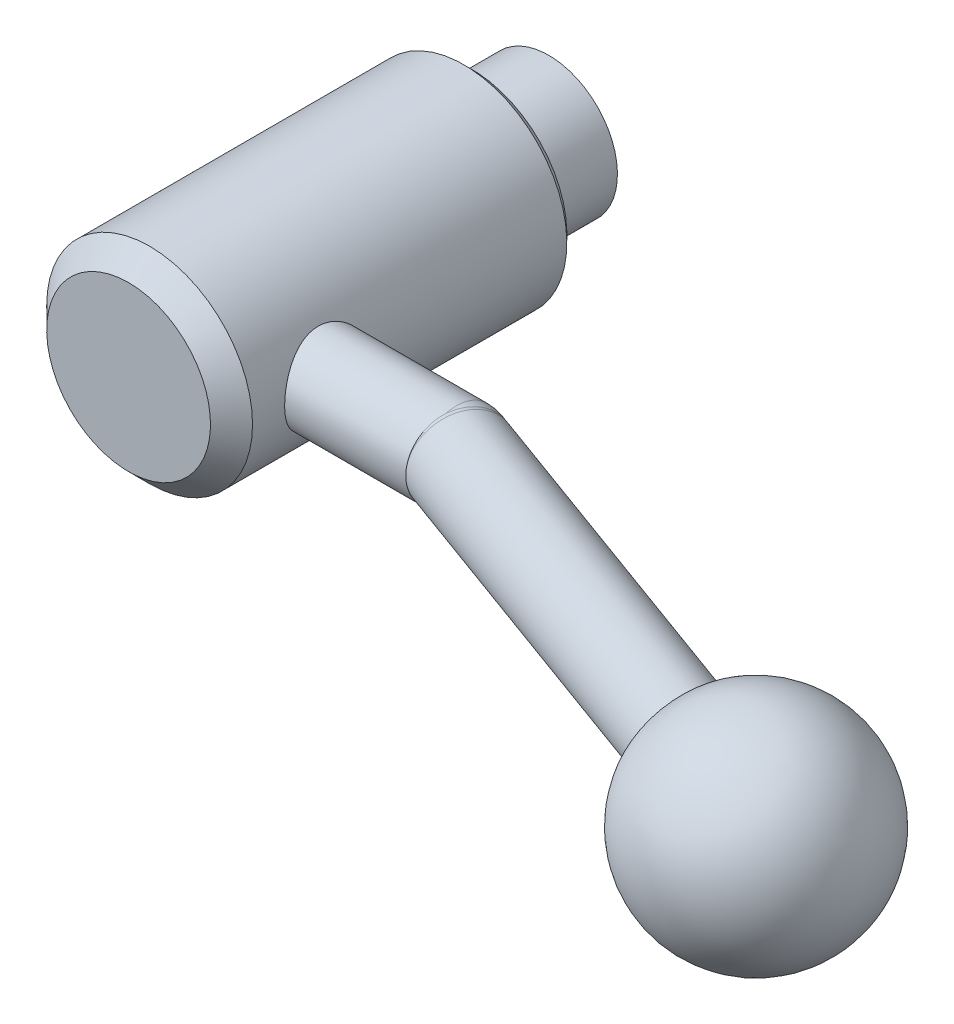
ISO-10303-21;
HEADER;
FILE_DESCRIPTION(('STEP AP214'),'2;1');
FILE_NAME('part.step','',(''),(''),'','','');
FILE_SCHEMA(('AUTOMOTIVE_DESIGN { 1 0 10303 214 1 1 1 1 }'));
ENDSEC;
DATA;
#1=APPLICATION_CONTEXT('core data for automotive mechanical design processes');
#2=APPLICATION_PROTOCOL_DEFINITION('international standard','automotive_design',2000,#1);
#3=PRODUCT_CONTEXT('',#1,'mechanical');
#4=PRODUCT('Part','Part','',(#3));
#5=PRODUCT_RELATED_PRODUCT_CATEGORY('part','',(#4));
#6=PRODUCT_DEFINITION_FORMATION('','',#4);
#7=PRODUCT_DEFINITION_CONTEXT('part definition',#1,'design');
#8=PRODUCT_DEFINITION('design','',#6,#7);
#9=PRODUCT_DEFINITION_SHAPE('','',#8);
#10=(LENGTH_UNIT() NAMED_UNIT(*) SI_UNIT(.MILLI.,.METRE.));
#11=(NAMED_UNIT(*) PLANE_ANGLE_UNIT() SI_UNIT($,.RADIAN.));
#12=(NAMED_UNIT(*) SI_UNIT($,.STERADIAN.) SOLID_ANGLE_UNIT());
#13=UNCERTAINTY_MEASURE_WITH_UNIT(LENGTH_MEASURE(1.E-05),#10,'distance_accuracy_value','');
#14=(GEOMETRIC_REPRESENTATION_CONTEXT(3) GLOBAL_UNCERTAINTY_ASSIGNED_CONTEXT((#13)) GLOBAL_UNIT_ASSIGNED_CONTEXT((#10,
#11,#12)) REPRESENTATION_CONTEXT('',''));
#15=CARTESIAN_POINT('',(0.,0.,0.));
#16=DIRECTION('',(0.,0.,1.));
#17=DIRECTION('',(1.,0.,0.));
#18=AXIS2_PLACEMENT_3D('',#15,#16,#17);
#19=CARTESIAN_POINT('',(4.,0.,0.));
#20=DIRECTION('',(0.,0.,-1.));
#21=DIRECTION('',(0.,1.,0.));
#22=AXIS2_PLACEMENT_3D('',#19,#20,#21);
#23=PLANE('',#22);
#24=CARTESIAN_POINT('',(0.,0.,0.));
#25=DIRECTION('',(0.,0.,-1.));
#26=DIRECTION('',(-1.,0.,0.));
#27=AXIS2_PLACEMENT_3D('',#24,#25,#26);
#28=CIRCLE('',#27,5.65);
#29=CARTESIAN_POINT('',(-5.65,0.,0.));
#30=VERTEX_POINT('',#29);
#31=EDGE_CURVE('E9',#30,#30,#28,.F.);
#32=ORIENTED_EDGE('',*,*,#31,.T.);
#33=EDGE_LOOP('',(#32));
#34=FACE_BOUND('',#33,.T.);
#35=CARTESIAN_POINT('',(0.,0.,0.));
#36=DIRECTION('',(0.,0.,1.));
#37=DIRECTION('',(0.,-1.,0.));
#38=AXIS2_PLACEMENT_3D('',#35,#36,#37);
#39=CIRCLE('',#38,8.);
#40=CARTESIAN_POINT('',(0.,-8.,0.));
#41=VERTEX_POINT('',#40);
#42=EDGE_CURVE('E286',#41,#41,#39,.T.);
#43=ORIENTED_EDGE('',*,*,#42,.F.);
#44=EDGE_LOOP('',(#43));
#45=FACE_BOUND('',#44,.T.);
#46=ADVANCED_FACE('F14',(#34,#45),#23,.T.);
#47=CARTESIAN_POINT('',(0.,0.,4.5));
#48=DIRECTION('',(0.,0.,1.));
#49=DIRECTION('',(0.,-1.,0.));
#50=AXIS2_PLACEMENT_3D('',#47,#48,#49);
#51=CYLINDRICAL_SURFACE('',#50,8.);
#52=CARTESIAN_POINT('',(0.,0.,9.));
#53=DIRECTION('',(0.,0.,1.));
#54=DIRECTION('',(0.,-1.,0.));
#55=AXIS2_PLACEMENT_3D('',#52,#53,#54);
#56=CIRCLE('',#55,8.);
#57=CARTESIAN_POINT('',(0.,-8.,9.));
#58=VERTEX_POINT('',#57);
#59=EDGE_CURVE('E281',#58,#58,#56,.T.);
#60=ORIENTED_EDGE('',*,*,#59,.F.);
#61=EDGE_LOOP('',(#60));
#62=FACE_BOUND('',#61,.T.);
#63=ORIENTED_EDGE('',*,*,#42,.T.);
#64=EDGE_LOOP('',(#63));
#65=FACE_BOUND('',#64,.T.);
#66=ADVANCED_FACE('F175',(#62,#65),#51,.T.);
#67=CARTESIAN_POINT('',(9.55,0.,9.));
#68=DIRECTION('',(0.,0.,-1.));
#69=DIRECTION('',(0.,1.,0.));
#70=AXIS2_PLACEMENT_3D('',#67,#68,#69);
#71=PLANE('',#70);
#72=ORIENTED_EDGE('',*,*,#59,.T.);
#73=EDGE_LOOP('',(#72));
#74=FACE_BOUND('',#73,.T.);
#75=CARTESIAN_POINT('',(0.,0.,9.));
#76=DIRECTION('',(0.,0.,1.));
#77=DIRECTION('',(0.,-1.,0.));
#78=AXIS2_PLACEMENT_3D('',#75,#76,#77);
#79=CIRCLE('',#78,11.1);
#80=CARTESIAN_POINT('',(0.,-11.1,9.));
#81=VERTEX_POINT('',#80);
#82=EDGE_CURVE('E277',#81,#81,#79,.T.);
#83=ORIENTED_EDGE('',*,*,#82,.F.);
#84=EDGE_LOOP('',(#83));
#85=FACE_BOUND('',#84,.T.);
#86=ADVANCED_FACE('F185',(#74,#85),#71,.T.);
#87=CARTESIAN_POINT('',(4.775,0.,49.));
#88=DIRECTION('',(0.,0.,1.));
#89=DIRECTION('',(0.,-1.,0.));
#90=AXIS2_PLACEMENT_3D('',#87,#88,#89);
#91=PLANE('',#90);
#92=CARTESIAN_POINT('',(0.,0.,49.));
#93=DIRECTION('',(0.,0.,-1.));
#94=DIRECTION('',(0.,1.,0.));
#95=AXIS2_PLACEMENT_3D('',#92,#93,#94);
#96=CIRCLE('',#95,9.55);
#97=CARTESIAN_POINT('',(0.,9.55,49.));
#98=VERTEX_POINT('',#97);
#99=EDGE_CURVE('E274',#98,#98,#96,.T.);
#100=ORIENTED_EDGE('',*,*,#99,.F.);
#101=EDGE_LOOP('',(#100));
#102=FACE_BOUND('',#101,.T.);
#103=ADVANCED_FACE('F195',(#102),#91,.T.);
#104=CARTESIAN_POINT('',(0.,0.,9.9));
#105=DIRECTION('',(0.,0.,1.));
#106=DIRECTION('',(0.,-1.,0.));
#107=AXIS2_PLACEMENT_3D('',#104,#105,#106);
#108=CONICAL_SURFACE('',#107,12.,0.785398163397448);
#109=ORIENTED_EDGE('',*,*,#82,.T.);
#110=EDGE_LOOP('',(#109));
#111=FACE_BOUND('',#110,.T.);
#112=CARTESIAN_POINT('',(0.,0.,9.9));
#113=DIRECTION('',(0.,0.,1.));
#114=DIRECTION('',(0.,-1.,0.));
#115=AXIS2_PLACEMENT_3D('',#112,#113,#114);
#116=CIRCLE('',#115,12.);
#117=CARTESIAN_POINT('',(0.,-12.,9.9));
#118=VERTEX_POINT('',#117);
#119=EDGE_CURVE('E107',#118,#118,#116,.T.);
#120=ORIENTED_EDGE('',*,*,#119,.F.);
#121=EDGE_LOOP('',(#120));
#122=FACE_BOUND('',#121,.T.);
#123=ADVANCED_FACE('F205',(#111,#122),#108,.T.);
#124=CARTESIAN_POINT('',(0.,0.,46.55));
#125=DIRECTION('',(0.,0.,-1.));
#126=DIRECTION('',(0.,1.,0.));
#127=AXIS2_PLACEMENT_3D('',#124,#125,#126);
#128=CONICAL_SURFACE('',#127,12.,0.785398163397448);
#129=CARTESIAN_POINT('',(0.,0.,46.55));
#130=DIRECTION('',(0.,0.,1.));
#131=DIRECTION('',(0.,-1.,0.));
#132=AXIS2_PLACEMENT_3D('',#129,#130,#131);
#133=CIRCLE('',#132,12.);
#134=CARTESIAN_POINT('',(0.,-12.,46.55));
#135=VERTEX_POINT('',#134);
#136=EDGE_CURVE('E47',#135,#135,#133,.F.);
#137=ORIENTED_EDGE('',*,*,#136,.F.);
#138=EDGE_LOOP('',(#137));
#139=FACE_BOUND('',#138,.T.);
#140=ORIENTED_EDGE('',*,*,#99,.T.);
#141=EDGE_LOOP('',(#140));
#142=FACE_BOUND('',#141,.T.);
#143=ADVANCED_FACE('F215',(#139,#142),#128,.T.);
#144=CARTESIAN_POINT('',(0.,0.,28.225));
#145=DIRECTION('',(0.,0.,1.));
#146=DIRECTION('',(0.,-1.,0.));
#147=AXIS2_PLACEMENT_3D('',#144,#145,#146);
#148=CYLINDRICAL_SURFACE('',#147,12.);
#149=ORIENTED_EDGE('',*,*,#119,.T.);
#150=EDGE_LOOP('',(#149));
#151=FACE_BOUND('',#150,.T.);
#152=ORIENTED_EDGE('',*,*,#136,.T.);
#153=EDGE_LOOP('',(#152));
#154=FACE_BOUND('',#153,.T.);
#155=CARTESIAN_POINT('',(10.9087121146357,-5.,37.8));
#156=CARTESIAN_POINT('',(10.9087074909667,-5.00000435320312,37.6663888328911));
#157=CARTESIAN_POINT('',(10.9111719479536,-4.9946421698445,37.532819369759));
#158=CARTESIAN_POINT('',(10.9209330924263,-4.97326581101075,37.2666742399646));
#159=CARTESIAN_POINT('',(10.9282304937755,-4.95725006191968,37.1340987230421));
#160=CARTESIAN_POINT('',(10.9474176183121,-4.91473148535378,36.8709152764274));
#161=CARTESIAN_POINT('',(10.9593097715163,-4.88822310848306,36.7403084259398));
#162=CARTESIAN_POINT('',(10.9872938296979,-4.82499419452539,36.4820015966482));
#163=CARTESIAN_POINT('',(11.0033874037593,-4.78826959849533,36.3543027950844));
#164=CARTESIAN_POINT('',(11.0391954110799,-4.7051251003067,36.1031731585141));
#165=CARTESIAN_POINT('',(11.0588958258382,-4.65874264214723,35.9797279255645));
#166=CARTESIAN_POINT('',(11.1013704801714,-4.55660310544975,35.7373089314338));
#167=CARTESIAN_POINT('',(11.1241458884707,-4.50084246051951,35.6183368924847));
#168=CARTESIAN_POINT('',(11.1961251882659,-4.32013829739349,35.2691963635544));
#169=CARTESIAN_POINT('',(11.2490137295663,-4.18170265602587,35.0465940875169));
#170=CARTESIAN_POINT('',(11.362232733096,-3.8638933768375,34.6146674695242));
#171=CARTESIAN_POINT('',(11.4228143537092,-3.68265681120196,34.4067915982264));
#172=CARTESIAN_POINT('',(11.5425745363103,-3.28806144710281,34.0231953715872));
#173=CARTESIAN_POINT('',(11.6017524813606,-3.07468881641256,33.8474889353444));
#174=CARTESIAN_POINT('',(11.6861286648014,-2.729351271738,33.6081642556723));
#175=CARTESIAN_POINT('',(11.7140590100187,-2.60716588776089,33.5310867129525));
#176=CARTESIAN_POINT('',(11.7671168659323,-2.35613739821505,33.3875758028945));
#177=CARTESIAN_POINT('',(11.7922454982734,-2.22729698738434,33.3211381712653));
#178=CARTESIAN_POINT('',(11.8389586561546,-1.96390692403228,33.1995551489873));
#179=CARTESIAN_POINT('',(11.8605461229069,-1.82936212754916,33.1444003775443));
#180=CARTESIAN_POINT('',(11.8995627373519,-1.55549044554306,33.0458826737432));
#181=CARTESIAN_POINT('',(11.9169929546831,-1.41616480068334,33.002516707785));
#182=CARTESIAN_POINT('',(11.9541941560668,-1.06793180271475,32.9106955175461));
#183=CARTESIAN_POINT('',(11.971276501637,-0.856830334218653,32.8692715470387));
#184=CARTESIAN_POINT('',(11.9941758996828,-0.430450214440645,32.8139291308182));
#185=CARTESIAN_POINT('',(11.9999946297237,-0.21517219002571,32.8000065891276));
#186=CARTESIAN_POINT('',(12.0000033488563,0.134179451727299,32.799995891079));
#187=CARTESIAN_POINT('',(11.9977460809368,0.268317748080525,32.8054032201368));
#188=CARTESIAN_POINT('',(11.9887853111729,0.535617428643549,32.8269647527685));
#189=CARTESIAN_POINT('',(11.9820811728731,0.668778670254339,32.8431204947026));
#190=CARTESIAN_POINT('',(11.9643973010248,0.933147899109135,32.8860218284));
#191=CARTESIAN_POINT('',(11.953415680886,1.06435499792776,32.9127720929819));
#192=CARTESIAN_POINT('',(11.9274624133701,1.32387896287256,32.9765977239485));
#193=CARTESIAN_POINT('',(11.9124892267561,1.45219469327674,33.0136770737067));
#194=CARTESIAN_POINT('',(11.8789883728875,1.70463818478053,33.0976767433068));
#195=CARTESIAN_POINT('',(11.8604718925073,1.82877771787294,33.1445661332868));
#196=CARTESIAN_POINT('',(11.8203169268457,2.0725349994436,33.2478413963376));
#197=CARTESIAN_POINT('',(11.798677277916,2.1921510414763,33.3042308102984));
#198=CARTESIAN_POINT('',(11.7298504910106,2.54307722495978,33.4869746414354));
#199=CARTESIAN_POINT('',(11.6787242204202,2.76669061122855,33.6269801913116));
#200=CARTESIAN_POINT('',(11.5683077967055,3.19783916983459,33.9465298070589));
#201=CARTESIAN_POINT('',(11.5087513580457,3.40417283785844,34.1275881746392));
#202=CARTESIAN_POINT('',(11.3892960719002,3.78466739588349,34.5211115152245));
#203=CARTESIAN_POINT('',(11.3293970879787,3.95881438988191,34.7335899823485));
#204=CARTESIAN_POINT('',(11.2426695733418,4.19642658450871,35.0777228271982));
#205=CARTESIAN_POINT('',(11.2136418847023,4.27318612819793,35.199855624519));
#206=CARTESIAN_POINT('',(11.1581434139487,4.41607290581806,35.4507224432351));
#207=CARTESIAN_POINT('',(11.1316715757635,4.48220453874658,35.5794537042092));
#208=CARTESIAN_POINT('',(11.0821579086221,4.60326626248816,35.8427214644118));
#209=CARTESIAN_POINT('',(11.0591162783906,4.65819570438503,35.9772582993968));
#210=CARTESIAN_POINT('',(11.017290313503,4.75627570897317,36.2511355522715));
#211=CARTESIAN_POINT('',(10.9985037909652,4.7994323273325,36.3904734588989));
#212=CARTESIAN_POINT('',(10.9666619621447,4.87173601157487,36.6661918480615));
#213=CARTESIAN_POINT('',(10.95337593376,4.9014533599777,36.8023961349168));
#214=CARTESIAN_POINT('',(10.9317788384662,4.94943495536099,37.0771389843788));
#215=CARTESIAN_POINT('',(10.9234654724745,4.96770449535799,37.2156764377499));
#216=CARTESIAN_POINT('',(10.9121183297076,4.99258064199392,37.4939753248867));
#217=CARTESIAN_POINT('',(10.9090831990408,4.9991902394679,37.6337364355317));
#218=CARTESIAN_POINT('',(10.9084052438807,5.00066966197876,37.9133300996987));
#219=CARTESIAN_POINT('',(10.9107621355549,4.99554010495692,38.0531626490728));
#220=CARTESIAN_POINT('',(10.9203897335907,4.97445537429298,38.3209853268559));
#221=CARTESIAN_POINT('',(10.9272683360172,4.95936367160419,38.449058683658));
#222=CARTESIAN_POINT('',(10.9453203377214,4.91939458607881,38.7034023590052));
#223=CARTESIAN_POINT('',(10.956495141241,4.89451400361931,38.8296720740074));
#224=CARTESIAN_POINT('',(10.9827914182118,4.83521904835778,39.079504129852));
#225=CARTESIAN_POINT('',(10.9979119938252,4.80080684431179,39.203067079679));
#226=CARTESIAN_POINT('',(11.0316484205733,4.72276748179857,39.4467742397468));
#227=CARTESIAN_POINT('',(11.0502656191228,4.67913677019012,39.566917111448));
#228=CARTESIAN_POINT('',(11.1114356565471,4.5329201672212,39.9260913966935));
#229=CARTESIAN_POINT('',(11.1587373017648,4.41622884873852,40.1587504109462));
#230=CARTESIAN_POINT('',(11.2607390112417,4.14922979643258,40.6019586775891));
#231=CARTESIAN_POINT('',(11.3154417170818,3.99891004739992,40.8124999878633));
#232=CARTESIAN_POINT('',(11.4317082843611,3.65402282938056,41.2243539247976));
#233=CARTESIAN_POINT('',(11.4934615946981,3.45679190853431,41.423388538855));
#234=CARTESIAN_POINT('',(11.6130178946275,3.03093539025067,41.786433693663));
#235=CARTESIAN_POINT('',(11.6708188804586,2.80229404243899,41.9504265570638));
#236=CARTESIAN_POINT('',(11.7505844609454,2.43719005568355,42.1681695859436));
#237=CARTESIAN_POINT('',(11.7762816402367,2.31013401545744,42.2366869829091));
#238=CARTESIAN_POINT('',(11.8243239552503,2.05007418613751,42.3626787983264));
#239=CARTESIAN_POINT('',(11.8466705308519,1.91707298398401,42.4201579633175));
#240=CARTESIAN_POINT('',(11.8873291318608,1.64624850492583,42.5234355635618));
#241=CARTESIAN_POINT('',(11.9056471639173,1.50843276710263,42.5692514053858));
#242=CARTESIAN_POINT('',(11.9377378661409,1.228899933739,42.6488050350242));
#243=CARTESIAN_POINT('',(11.9515124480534,1.08718450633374,42.6825479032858));
#244=CARTESIAN_POINT('',(11.9750487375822,0.788932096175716,42.7398925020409));
#245=CARTESIAN_POINT('',(11.9843764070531,0.632149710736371,42.7624048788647));
#246=CARTESIAN_POINT('',(11.9968515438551,0.316905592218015,42.7924579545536));
#247=CARTESIAN_POINT('',(11.9999991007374,0.158443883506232,42.7999988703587));
#248=CARTESIAN_POINT('',(12.0000007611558,-0.134110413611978,42.8000009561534));
#249=CARTESIAN_POINT('',(11.9977471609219,-0.268208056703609,42.7946001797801));
#250=CARTESIAN_POINT('',(11.9887940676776,-0.535433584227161,42.7730555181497));
#251=CARTESIAN_POINT('',(11.9820932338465,-0.668561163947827,42.7569083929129));
#252=CARTESIAN_POINT('',(11.9644136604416,-0.932940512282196,42.7140182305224));
#253=CARTESIAN_POINT('',(11.9534307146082,-1.06419030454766,42.6872647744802));
#254=CARTESIAN_POINT('',(11.9274719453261,-1.32379800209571,42.6234258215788));
#255=CARTESIAN_POINT('',(11.9124945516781,-1.45215474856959,42.5863362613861));
#256=CARTESIAN_POINT('',(11.8789871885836,-1.70464692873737,42.5023203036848));
#257=CARTESIAN_POINT('',(11.8604692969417,-1.82879507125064,42.4554272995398));
#258=CARTESIAN_POINT('',(11.8203109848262,-2.07256946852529,42.3521432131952));
#259=CARTESIAN_POINT('',(11.798669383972,-2.19219399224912,42.2957485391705));
#260=CARTESIAN_POINT('',(11.7298430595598,-2.5431097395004,42.1130050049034));
#261=CARTESIAN_POINT('',(11.678720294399,-2.76670593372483,41.9730084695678));
#262=CARTESIAN_POINT('',(11.5683124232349,-3.19782111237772,41.6534835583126));
#263=CARTESIAN_POINT('',(11.5087611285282,-3.40413902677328,41.4724414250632));
#264=CARTESIAN_POINT('',(11.3893058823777,-3.78463884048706,41.0789233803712));
#265=CARTESIAN_POINT('',(11.3294017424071,-3.95880157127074,40.8664288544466));
#266=CARTESIAN_POINT('',(11.2426570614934,-4.19646089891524,40.5222273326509));
#267=CARTESIAN_POINT('',(11.2136175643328,-4.27325053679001,40.4000414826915));
#268=CARTESIAN_POINT('',(11.1580975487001,-4.41618919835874,40.1490631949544));
#269=CARTESIAN_POINT('',(11.1316160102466,-4.48234247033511,40.0202734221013));
#270=CARTESIAN_POINT('',(11.0821110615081,-4.60337872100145,39.757006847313));
#271=CARTESIAN_POINT('',(11.059084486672,-4.65827203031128,39.6225353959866));
#272=CARTESIAN_POINT('',(11.0172786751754,-4.75630122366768,39.3487863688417));
#273=CARTESIAN_POINT('',(10.9984982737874,-4.79944033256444,39.2095101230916));
#274=CARTESIAN_POINT('',(10.9584249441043,-4.89044651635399,38.8624381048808));
#275=CARTESIAN_POINT('',(10.9399177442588,-4.93143703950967,38.6524635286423));
#276=CARTESIAN_POINT('',(10.9150663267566,-4.98620740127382,38.228289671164));
#277=CARTESIAN_POINT('',(10.9087195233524,-4.9999930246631,38.0140912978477));
#278=CARTESIAN_POINT('',(10.9087121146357,-5.,37.8));
#279=B_SPLINE_CURVE_WITH_KNOTS('',3,(#155,#156,#157,#158,#159,#160,#161,#162,#163,#164,#165,
#166,#167,#168,#169,#170,#171,#172,#173,#174,#175,#176,#177,#178,#179,#180,#181,#182,#183,#184,
#185,#186,#187,#188,#189,#190,#191,#192,#193,#194,#195,#196,#197,#198,#199,#200,#201,#202,#203,
#204,#205,#206,#207,#208,#209,#210,#211,#212,#213,#214,#215,#216,#217,#218,#219,#220,#221,#222,
#223,#224,#225,#226,#227,#228,#229,#230,#231,#232,#233,#234,#235,#236,#237,#238,#239,#240,#241,
#242,#243,#244,#245,#246,#247,#248,#249,#250,#251,#252,#253,#254,#255,#256,#257,#258,#259,#260,
#261,#262,#263,#264,#265,#266,#267,#268,#269,#270,#271,#272,#273,#274,#275,#276,#277,#278),
.UNSPECIFIED.,.T.,.F.,(4,2,2,2,2,2,2,2,2,2,2,2,2,2,2,2,2,2,2,2,2,2,2,2,2,2,2,2,2,2,2,2,2,2,2,2,
2,2,2,2,2,2,2,2,2,2,2,2,2,2,2,2,2,2,2,2,2,2,2,2,2,4),(0.,0.400632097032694,0.801323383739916,
1.20222687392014,1.60328987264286,2.00282595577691,2.4025143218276,3.20122978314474,
4.04481584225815,4.88876604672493,5.32972022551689,5.77049723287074,6.21090626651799,
6.65120186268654,7.29649650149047,7.94169502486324,8.34403504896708,8.74643267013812,
9.14900797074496,9.55173873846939,9.95321838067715,10.3548479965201,11.1573969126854,
11.9966160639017,12.8361966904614,13.2771668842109,13.7179540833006,14.1587668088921,
14.5993523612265,15.0189121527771,15.4382778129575,15.8575358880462,16.2767718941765,
16.6637453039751,17.0508453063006,17.4378573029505,17.8250187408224,18.6150346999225,
19.405333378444,20.2623217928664,21.1197415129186,21.5591319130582,21.9983329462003,
22.4368746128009,22.875231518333,23.3503940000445,23.8255495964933,24.2277318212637,
24.6300353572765,25.0327350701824,25.4355933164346,25.8371010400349,26.2387608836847,
27.041251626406,27.880402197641,28.7200514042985,29.161206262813,29.6021844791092,
30.042756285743,30.4832070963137,31.1252948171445,31.767245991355),.UNSPECIFIED.);
#280=CARTESIAN_POINT('',(10.9087121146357,-5.,37.8));
#281=VERTEX_POINT('',#280);
#282=EDGE_CURVE('E46',#281,#281,#279,.T.);
#283=ORIENTED_EDGE('',*,*,#282,.F.);
#284=EDGE_LOOP('',(#283));
#285=FACE_BOUND('',#284,.T.);
#286=ADVANCED_FACE('F225',(#151,#154,#285),#148,.T.);
#287=CARTESIAN_POINT('',(27.,0.,37.8));
#288=DIRECTION('',(1.,0.,0.));
#289=DIRECTION('',(0.,0.,1.));
#290=AXIS2_PLACEMENT_3D('',#287,#288,#289);
#291=SPHERICAL_SURFACE('',#290,5.);
#292=CARTESIAN_POINT('',(27.,0.,37.8));
#293=DIRECTION('',(-1.,0.,0.));
#294=DIRECTION('',(0.,-1.,0.));
#295=AXIS2_PLACEMENT_3D('',#292,#293,#294);
#296=CIRCLE('',#295,5.);
#297=CARTESIAN_POINT('',(27.,4.83102779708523,39.0888640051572));
#298=VERTEX_POINT('',#297);
#299=CARTESIAN_POINT('',(27.,-4.83102779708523,39.0888640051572));
#300=VERTEX_POINT('',#299);
#301=EDGE_CURVE('E35',#298,#300,#296,.T.);
#302=ORIENTED_EDGE('',*,*,#301,.F.);
#303=CARTESIAN_POINT('',(27.,-4.83102779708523,39.0888640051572));
#304=CARTESIAN_POINT('',(27.046470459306,-4.86510599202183,38.9611874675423));
#305=CARTESIAN_POINT('',(27.0934341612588,-4.89342279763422,38.832155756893));
#306=CARTESIAN_POINT('',(27.1880079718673,-4.93839650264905,38.5723163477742));
#307=CARTESIAN_POINT('',(27.2356180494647,-4.95505396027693,38.441508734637));
#308=CARTESIAN_POINT('',(27.331115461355,-4.97656756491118,38.179131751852));
#309=CARTESIAN_POINT('',(27.379002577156,-4.9814320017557,38.0475629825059));
#310=CARTESIAN_POINT('',(27.4747462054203,-4.9793538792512,37.7845095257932));
#311=CARTESIAN_POINT('',(27.5226027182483,-4.97241146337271,37.6530248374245));
#312=CARTESIAN_POINT('',(27.6179594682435,-4.94676429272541,37.39103432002));
#313=CARTESIAN_POINT('',(27.665459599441,-4.92805616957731,37.2605287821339));
#314=CARTESIAN_POINT('',(27.7597694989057,-4.87899874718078,37.0014144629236));
#315=CARTESIAN_POINT('',(27.8065790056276,-4.8486451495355,36.8728064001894));
#316=CARTESIAN_POINT('',(27.8991305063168,-4.77653351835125,36.6185232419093));
#317=CARTESIAN_POINT('',(27.9448730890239,-4.73478194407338,36.4928465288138));
#318=CARTESIAN_POINT('',(28.0350097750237,-4.6401460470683,36.2451980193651));
#319=CARTESIAN_POINT('',(28.0794033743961,-4.58725762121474,36.1232276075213));
#320=CARTESIAN_POINT('',(28.1664936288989,-4.47075360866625,35.8839490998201));
#321=CARTESIAN_POINT('',(28.2091908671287,-4.40714174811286,35.7666394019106));
#322=CARTESIAN_POINT('',(28.2926167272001,-4.2696046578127,35.5374287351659));
#323=CARTESIAN_POINT('',(28.3333446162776,-4.19567562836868,35.4255297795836));
#324=CARTESIAN_POINT('',(28.4125166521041,-4.03806489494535,35.2080063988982));
#325=CARTESIAN_POINT('',(28.4509612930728,-3.95438531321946,35.1023806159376));
#326=CARTESIAN_POINT('',(28.5253169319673,-3.77782268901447,34.8980901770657));
#327=CARTESIAN_POINT('',(28.5612269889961,-3.68493625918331,34.7994281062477));
#328=CARTESIAN_POINT('',(28.6302280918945,-3.49068679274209,34.6098491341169));
#329=CARTESIAN_POINT('',(28.6633202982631,-3.38932728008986,34.5189290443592));
#330=CARTESIAN_POINT('',(28.7264788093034,-3.17877990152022,34.3454024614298));
#331=CARTESIAN_POINT('',(28.7565439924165,-3.06958915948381,34.2627990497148));
#332=CARTESIAN_POINT('',(28.8134084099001,-2.84423774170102,34.1065653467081));
#333=CARTESIAN_POINT('',(28.8402090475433,-2.72808009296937,34.0329311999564));
#334=CARTESIAN_POINT('',(28.8903782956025,-2.4895338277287,33.8950923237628));
#335=CARTESIAN_POINT('',(28.9137456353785,-2.36714292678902,33.8308910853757));
#336=CARTESIAN_POINT('',(28.9568627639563,-2.11708267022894,33.7124277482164));
#337=CARTESIAN_POINT('',(28.9766138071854,-1.98941516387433,33.6581622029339));
#338=CARTESIAN_POINT('',(29.0123746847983,-1.72962465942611,33.5599099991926));
#339=CARTESIAN_POINT('',(29.0283831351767,-1.5975000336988,33.5159271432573));
#340=CARTESIAN_POINT('',(29.0565303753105,-1.32981336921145,33.4385932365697));
#341=CARTESIAN_POINT('',(29.0686705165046,-1.19425254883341,33.40523847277));
#342=CARTESIAN_POINT('',(29.0890073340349,-0.920611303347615,33.3493635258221));
#343=CARTESIAN_POINT('',(29.0972025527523,-0.782529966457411,33.3268473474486));
#344=CARTESIAN_POINT('',(29.1157561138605,-0.366076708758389,33.275871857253));
#345=CARTESIAN_POINT('',(29.1201131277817,-0.0852019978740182,33.2639010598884));
#346=CARTESIAN_POINT('',(29.1126324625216,0.474546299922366,33.2844540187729));
#347=CARTESIAN_POINT('',(29.1007947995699,0.753419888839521,33.3169777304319));
#348=CARTESIAN_POINT('',(29.0612756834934,1.30144109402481,33.4255556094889));
#349=CARTESIAN_POINT('',(29.0335941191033,1.5705886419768,33.5016100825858));
#350=CARTESIAN_POINT('',(28.9631693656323,2.09146114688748,33.695100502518));
#351=CARTESIAN_POINT('',(28.9204263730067,2.34318633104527,33.8125359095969));
#352=CARTESIAN_POINT('',(28.8210936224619,2.82208357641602,34.085450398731));
#353=CARTESIAN_POINT('',(28.764504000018,3.04925587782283,34.2409291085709));
#354=CARTESIAN_POINT('',(28.6390816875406,3.47260490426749,34.5855240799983));
#355=CARTESIAN_POINT('',(28.570248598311,3.66878061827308,34.7746414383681));
#356=CARTESIAN_POINT('',(28.4222952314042,4.02455922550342,35.1811399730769));
#357=CARTESIAN_POINT('',(28.3431749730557,4.18416218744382,35.3985210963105));
#358=CARTESIAN_POINT('',(28.1768942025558,4.46226027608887,35.8553737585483));
#359=CARTESIAN_POINT('',(28.0897339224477,4.58075658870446,36.0948446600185));
#360=CARTESIAN_POINT('',(27.9098378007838,4.77329945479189,36.5891051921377));
#361=CARTESIAN_POINT('',(27.8171011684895,4.84733968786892,36.8438969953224));
#362=CARTESIAN_POINT('',(27.6287009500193,4.94882287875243,37.3615223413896));
#363=CARTESIAN_POINT('',(27.5330381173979,4.97627773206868,37.6243538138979));
#364=CARTESIAN_POINT('',(27.3636614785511,4.98299294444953,38.0897123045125));
#365=CARTESIAN_POINT('',(27.2899803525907,4.97191840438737,38.2921495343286));
#366=CARTESIAN_POINT('',(27.1803577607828,4.93453780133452,38.593335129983));
#367=CARTESIAN_POINT('',(27.1439766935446,4.91862341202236,38.6932912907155));
#368=CARTESIAN_POINT('',(27.0716363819,4.87994547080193,38.8920446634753));
#369=CARTESIAN_POINT('',(27.035677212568,4.8571807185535,38.9908416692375));
#370=CARTESIAN_POINT('',(27.,4.83102779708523,39.0888640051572));
#371=B_SPLINE_CURVE_WITH_KNOTS('',3,(#303,#304,#305,#306,#307,#308,#309,#310,#311,#312,#313,
#314,#315,#316,#317,#318,#319,#320,#321,#322,#323,#324,#325,#326,#327,#328,#329,#330,#331,#332,
#333,#334,#335,#336,#337,#338,#339,#340,#341,#342,#343,#344,#345,#346,#347,#348,#349,#350,#351,
#352,#353,#354,#355,#356,#357,#358,#359,#360,#361,#362,#363,#364,#365,#366,#367,#368,#369,#370),
.UNSPECIFIED.,.F.,.F.,(4,2,2,2,2,2,2,2,2,2,2,2,2,2,2,2,2,2,2,2,2,2,2,2,2,2,2,2,2,2,2,2,2,4),(0.,
0.420108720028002,0.840197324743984,1.25999054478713,1.67977866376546,2.09968701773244,
2.51975051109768,2.93957644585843,3.35955732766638,3.77939257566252,4.19938285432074,
4.61928189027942,5.0393359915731,5.45921625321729,5.87925151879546,6.2991055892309,
6.71911465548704,7.13897775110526,7.55899586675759,7.97886708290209,8.39889331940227,
9.23803635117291,10.0771785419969,10.9163266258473,11.7554637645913,12.5945926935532,
13.4337489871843,14.2729037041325,15.1120342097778,15.9512839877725,16.7903194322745,
17.4356040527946,17.7580678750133,18.0805882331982),.UNSPECIFIED.);
#372=EDGE_CURVE('E49',#300,#298,#371,.T.);
#373=ORIENTED_EDGE('',*,*,#372,.F.);
#374=EDGE_LOOP('',(#302,#373));
#375=FACE_BOUND('',#374,.T.);
#376=ADVANCED_FACE('F50',(#375),#291,.T.);
#377=CARTESIAN_POINT('',(13.5,0.,37.8));
#378=DIRECTION('',(-1.,0.,0.));
#379=DIRECTION('',(0.,-1.,0.));
#380=AXIS2_PLACEMENT_3D('',#377,#378,#379);
#381=CYLINDRICAL_SURFACE('',#380,5.);
#382=CARTESIAN_POINT('',(26.1183650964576,0.,42.8));
#383=CARTESIAN_POINT('',(26.1183663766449,-0.138781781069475,42.8000146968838));
#384=CARTESIAN_POINT('',(26.1193840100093,-0.277557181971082,42.7942220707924));
#385=CARTESIAN_POINT('',(26.1234602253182,-0.554109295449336,42.771134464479));
#386=CARTESIAN_POINT('',(26.1265186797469,-0.691886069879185,42.7538402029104));
#387=CARTESIAN_POINT('',(26.134682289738,-0.96538924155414,42.7078755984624));
#388=CARTESIAN_POINT('',(26.1397861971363,-1.10111683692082,42.6792121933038));
#389=CARTESIAN_POINT('',(26.1520544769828,-1.36960411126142,42.6107588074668));
#390=CARTESIAN_POINT('',(26.159218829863,-1.50236381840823,42.5709689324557));
#391=CARTESIAN_POINT('',(26.1838439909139,-1.89485404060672,42.4353009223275));
#392=CARTESIAN_POINT('',(26.2044413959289,-2.14895022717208,42.3230982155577));
#393=CARTESIAN_POINT('',(26.2542951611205,-2.63434856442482,42.0587041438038));
#394=CARTESIAN_POINT('',(26.283548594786,-2.86565838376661,41.9065262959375));
#395=CARTESIAN_POINT('',(26.3343916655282,-3.19109256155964,41.6517642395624));
#396=CARTESIAN_POINT('',(26.3525481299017,-3.29619219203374,41.562198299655));
#397=CARTESIAN_POINT('',(26.3913190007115,-3.49841986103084,41.3749160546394));
#398=CARTESIAN_POINT('',(26.4119334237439,-3.59554784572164,41.2771996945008));
#399=CARTESIAN_POINT('',(26.4557847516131,-3.78117775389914,41.0743867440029));
#400=CARTESIAN_POINT('',(26.4790225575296,-3.86967669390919,40.9692876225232));
#401=CARTESIAN_POINT('',(26.5283452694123,-4.0374486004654,40.7525886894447));
#402=CARTESIAN_POINT('',(26.5544301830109,-4.11672154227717,40.6409888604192));
#403=CARTESIAN_POINT('',(26.6091879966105,-4.26396916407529,40.4146533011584));
#404=CARTESIAN_POINT('',(26.6377946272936,-4.33214705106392,40.3000335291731));
#405=CARTESIAN_POINT('',(26.6984986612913,-4.45880346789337,40.0664315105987));
#406=CARTESIAN_POINT('',(26.730595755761,-4.51728285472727,39.9474496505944));
#407=CARTESIAN_POINT('',(26.7818810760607,-4.59750472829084,39.7665481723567));
#408=CARTESIAN_POINT('',(26.7995055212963,-4.6230026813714,39.7058233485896));
#409=CARTESIAN_POINT('',(26.8359327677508,-4.67147271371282,39.5837195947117));
#410=CARTESIAN_POINT('',(26.8547355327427,-4.69444487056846,39.5223406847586));
#411=CARTESIAN_POINT('',(26.8936808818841,-4.73784744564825,39.3990839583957));
#412=CARTESIAN_POINT('',(26.9138239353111,-4.75827696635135,39.3372059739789));
#413=CARTESIAN_POINT('',(26.9556781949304,-4.7965760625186,39.2131810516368));
#414=CARTESIAN_POINT('',(26.9773895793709,-4.81444534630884,39.1510340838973));
#415=CARTESIAN_POINT('',(27.,-4.83102779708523,39.0888640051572));
#416=B_SPLINE_CURVE_WITH_KNOTS('',3,(#382,#383,#384,#385,#386,#387,#388,#389,#390,#391,#392,
#393,#394,#395,#396,#397,#398,#399,#400,#401,#402,#403,#404,#405,#406,#407,#408,#409,#410,#411,
#412,#413,#414,#415),.UNSPECIFIED.,.F.,.F.,(4,2,2,2,2,2,2,2,2,2,2,2,2,2,2,2,4),(0.,
0.416209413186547,0.832392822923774,1.24832265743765,1.66424854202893,2.49563578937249,
3.32674227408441,3.74416003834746,4.16158062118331,4.57914501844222,4.99671053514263,
5.4054598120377,5.81417295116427,6.01865864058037,6.22313804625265,6.42768942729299,
6.63226409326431),.UNSPECIFIED.);
#417=CARTESIAN_POINT('',(26.1183650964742,0.,42.8));
#418=VERTEX_POINT('',#417);
#419=EDGE_CURVE('E42',#418,#300,#416,.T.);
#420=ORIENTED_EDGE('',*,*,#419,.F.);
#421=CARTESIAN_POINT('',(27.,4.83102779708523,39.0888640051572));
#422=CARTESIAN_POINT('',(26.9769275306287,4.81410598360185,39.1523072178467));
#423=CARTESIAN_POINT('',(26.9547902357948,4.7958439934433,39.2157257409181));
#424=CARTESIAN_POINT('',(26.9121439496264,4.75665385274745,39.3422777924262));
#425=CARTESIAN_POINT('',(26.8916347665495,4.73572601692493,39.4054113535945));
#426=CARTESIAN_POINT('',(26.8520041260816,4.69122201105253,39.531151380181));
#427=CARTESIAN_POINT('',(26.8328821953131,4.66764675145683,39.5937580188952));
#428=CARTESIAN_POINT('',(26.7958563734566,4.61786764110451,39.7182794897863));
#429=CARTESIAN_POINT('',(26.7779525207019,4.59166370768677,39.7801943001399));
#430=CARTESIAN_POINT('',(26.7258878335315,4.50918530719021,39.9645681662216));
#431=CARTESIAN_POINT('',(26.6933404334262,4.44900605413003,40.0857648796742));
#432=CARTESIAN_POINT('',(26.6318437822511,4.31857552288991,40.3235503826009));
#433=CARTESIAN_POINT('',(26.6028947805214,4.24832354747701,40.4401388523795));
#434=CARTESIAN_POINT('',(26.5481524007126,4.0982165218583,40.6676074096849));
#435=CARTESIAN_POINT('',(26.5223565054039,4.01836923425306,40.7784920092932));
#436=CARTESIAN_POINT('',(26.4735791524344,3.84952818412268,40.9937191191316));
#437=CARTESIAN_POINT('',(26.4505976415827,3.76053459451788,41.0980617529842));
#438=CARTESIAN_POINT('',(26.4072342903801,3.57400503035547,41.299329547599));
#439=CARTESIAN_POINT('',(26.3868516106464,3.47647183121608,41.396257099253));
#440=CARTESIAN_POINT('',(26.3485188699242,3.27348573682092,41.5819590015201));
#441=CARTESIAN_POINT('',(26.3305688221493,3.16803279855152,41.6707333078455));
#442=CARTESIAN_POINT('',(26.2968121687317,2.94879128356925,41.8403010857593));
#443=CARTESIAN_POINT('',(26.2810296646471,2.83492774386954,41.9210024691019));
#444=CARTESIAN_POINT('',(26.2517361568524,2.60058879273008,42.0727547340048));
#445=CARTESIAN_POINT('',(26.2382262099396,2.48011033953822,42.1438011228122));
#446=CARTESIAN_POINT('',(26.2134181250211,2.23340315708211,42.2756541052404));
#447=CARTESIAN_POINT('',(26.2021207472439,2.10717246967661,42.3364571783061));
#448=CARTESIAN_POINT('',(26.1817011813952,1.8499642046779,42.4472822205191));
#449=CARTESIAN_POINT('',(26.1725779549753,1.71898892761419,42.4973093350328));
#450=CARTESIAN_POINT('',(26.1567996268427,1.4586904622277,42.5843776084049));
#451=CARTESIAN_POINT('',(26.1500579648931,1.32952345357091,42.6218707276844));
#452=CARTESIAN_POINT('',(26.1385146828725,1.06850893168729,42.6863443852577));
#453=CARTESIAN_POINT('',(26.1337130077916,0.936661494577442,42.7133252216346));
#454=CARTESIAN_POINT('',(26.1260342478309,0.671136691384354,42.7565777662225));
#455=CARTESIAN_POINT('',(26.1231575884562,0.537458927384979,42.7728471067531));
#456=CARTESIAN_POINT('',(26.1193234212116,0.269188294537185,42.7945658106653));
#457=CARTESIAN_POINT('',(26.1183660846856,0.134595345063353,42.8000142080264));
#458=CARTESIAN_POINT('',(26.1183650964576,0.,42.8));
#459=B_SPLINE_CURVE_WITH_KNOTS('',3,(#421,#422,#423,#424,#425,#426,#427,#428,#429,#430,#431,
#432,#433,#434,#435,#436,#437,#438,#439,#440,#441,#442,#443,#444,#445,#446,#447,#448,#449,#450,
#451,#452,#453,#454,#455,#456,#457,#458),.UNSPECIFIED.,.F.,.F.,(4,2,2,2,2,2,2,2,2,2,2,2,2,2,2,2,
2,2,4),(0.,0.208761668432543,0.417498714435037,0.62616419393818,0.834836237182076,
1.2518228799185,1.66883840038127,2.08551879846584,2.50219132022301,2.91872892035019,
3.3352687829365,3.75611885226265,4.17716408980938,4.59835374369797,5.01934183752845,
5.42289691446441,5.82644054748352,6.23007335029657,6.63374218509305),.UNSPECIFIED.);
#460=EDGE_CURVE('E44',#298,#418,#459,.T.);
#461=ORIENTED_EDGE('',*,*,#460,.F.);
#462=ORIENTED_EDGE('',*,*,#301,.T.);
#463=EDGE_LOOP('',(#420,#461,#462));
#464=FACE_BOUND('',#463,.T.);
#465=ORIENTED_EDGE('',*,*,#282,.T.);
#466=EDGE_LOOP('',(#465));
#467=FACE_BOUND('',#466,.T.);
#468=ADVANCED_FACE('F39',(#464,#467),#381,.T.);
#469=CARTESIAN_POINT('',(27.828465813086,0.,38.1015368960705));
#470=DIRECTION('',(1.,0.,0.));
#471=DIRECTION('',(0.,0.,1.));
#472=AXIS2_PLACEMENT_3D('',#469,#470,#471);
#473=SPHERICAL_SURFACE('',#472,5.);
#474=ORIENTED_EDGE('',*,*,#372,.T.);
#475=ORIENTED_EDGE('',*,*,#460,.T.);
#476=CARTESIAN_POINT('',(27.8284658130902,0.,38.101536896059));
#477=DIRECTION('',(-0.939692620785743,0.,-0.342020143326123));
#478=DIRECTION('',(0.342020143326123,0.,-0.939692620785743));
#479=AXIS2_PLACEMENT_3D('',#476,#477,#478);
#480=CIRCLE('',#479,5.);
#481=EDGE_CURVE('E55',#418,#418,#480,.F.);
#482=ORIENTED_EDGE('',*,*,#481,.F.);
#483=ORIENTED_EDGE('',*,*,#419,.T.);
#484=EDGE_LOOP('',(#474,#475,#482,#483));
#485=FACE_BOUND('',#484,.T.);
#486=ADVANCED_FACE('F54',(#485),#473,.T.);
#487=CARTESIAN_POINT('',(51.3773730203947,0.,46.6726381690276));
#488=DIRECTION('',(-0.939692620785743,0.,-0.342020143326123));
#489=DIRECTION('',(0.342020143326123,0.,-0.939692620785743));
#490=AXIS2_PLACEMENT_3D('',#487,#488,#489);
#491=CYLINDRICAL_SURFACE('',#490,5.);
#492=ORIENTED_EDGE('',*,*,#481,.T.);
#493=EDGE_LOOP('',(#492));
#494=FACE_BOUND('',#493,.T.);
#495=CARTESIAN_POINT('',(74.9262802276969,0.,55.2437394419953));
#496=DIRECTION('',(-0.939692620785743,0.,-0.342020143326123));
#497=DIRECTION('',(0.342020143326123,0.,-0.939692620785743));
#498=AXIS2_PLACEMENT_3D('',#495,#496,#497);
#499=CIRCLE('',#498,5.);
#500=CARTESIAN_POINT('',(76.6363809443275,0.,50.5452763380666));
#501=VERTEX_POINT('',#500);
#502=EDGE_CURVE('E106',#501,#501,#499,.F.);
#503=ORIENTED_EDGE('',*,*,#502,.F.);
#504=EDGE_LOOP('',(#503));
#505=FACE_BOUND('',#504,.T.);
#506=ADVANCED_FACE('F81',(#494,#505),#491,.T.);
#507=CARTESIAN_POINT('',(72.3611291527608,0.,62.2914340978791));
#508=DIRECTION('',(-0.939692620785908,0.,-0.342020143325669));
#509=DIRECTION('',(0.342020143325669,0.,-0.939692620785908));
#510=AXIS2_PLACEMENT_3D('',#507,#508,#509);
#511=PLANE('',#510);
#512=CARTESIAN_POINT('',(71.5060787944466,0.,64.6406656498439));
#513=CARTESIAN_POINT('',(71.5060781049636,-0.280953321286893,64.640667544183));
#514=CARTESIAN_POINT('',(71.5101300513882,-0.561873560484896,64.6295349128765));
#515=CARTESIAN_POINT('',(71.5263095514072,-1.1218110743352,64.5850821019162));
#516=CARTESIAN_POINT('',(71.5384392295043,-1.40082782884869,64.5517560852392));
#517=CARTESIAN_POINT('',(71.5707081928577,-1.95517499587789,64.4630978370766));
#518=CARTESIAN_POINT('',(71.5908560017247,-2.23050116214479,64.407742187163));
#519=CARTESIAN_POINT('',(71.6390178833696,-2.77521418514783,64.2754185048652));
#520=CARTESIAN_POINT('',(71.6670320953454,-3.04460093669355,64.1984500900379));
#521=CARTESIAN_POINT('',(71.730711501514,-3.57537953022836,64.0234923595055));
#522=CARTESIAN_POINT('',(71.7663729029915,-3.83677526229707,63.9255134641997));
#523=CARTESIAN_POINT('',(71.8451018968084,-4.34985680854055,63.7092073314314));
#524=CARTESIAN_POINT('',(71.8881696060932,-4.60154246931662,63.5908797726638));
#525=CARTESIAN_POINT('',(71.9813930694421,-5.09334893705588,63.3347504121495));
#526=CARTESIAN_POINT('',(72.0315470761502,-5.33347257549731,63.1969534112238));
#527=CARTESIAN_POINT('',(72.1385934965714,-5.80050958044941,62.9028457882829));
#528=CARTESIAN_POINT('',(72.1954857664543,-6.02742322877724,62.7465355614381));
#529=CARTESIAN_POINT('',(72.3156121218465,-6.4664582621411,62.4164911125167));
#530=CARTESIAN_POINT('',(72.3788469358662,-6.67857794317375,62.2427548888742));
#531=CARTESIAN_POINT('',(72.5112034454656,-7.08648858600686,61.879108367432));
#532=CARTESIAN_POINT('',(72.580325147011,-7.28227953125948,61.6891980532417));
#533=CARTESIAN_POINT('',(72.7239667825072,-7.6561478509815,61.2945459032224));
#534=CARTESIAN_POINT('',(72.7984869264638,-7.83422453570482,61.0898034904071));
#535=CARTESIAN_POINT('',(72.9523932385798,-8.17138956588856,60.666949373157));
#536=CARTESIAN_POINT('',(73.0317794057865,-8.33047791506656,60.4488376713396));
#537=CARTESIAN_POINT('',(73.1948518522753,-8.62853248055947,60.0007998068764));
#538=CARTESIAN_POINT('',(73.2785380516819,-8.76749907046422,59.7708738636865));
#539=CARTESIAN_POINT('',(73.4496169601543,-9.02432566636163,59.3008384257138));
#540=CARTESIAN_POINT('',(73.5370096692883,-9.14218567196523,59.0607289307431));
#541=CARTESIAN_POINT('',(73.7148801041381,-9.35596096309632,58.5720339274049));
#542=CARTESIAN_POINT('',(73.8053578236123,-9.45187629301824,58.3234484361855));
#543=CARTESIAN_POINT('',(73.9887552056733,-9.62108063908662,57.8195682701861));
#544=CARTESIAN_POINT('',(74.0816748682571,-9.69436965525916,57.5642735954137));
#545=CARTESIAN_POINT('',(74.269295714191,-9.81780045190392,57.0487895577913));
#546=CARTESIAN_POINT('',(74.3639969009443,-9.86794218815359,56.7886001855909));
#547=CARTESIAN_POINT('',(74.5545073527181,-9.94472174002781,56.2651770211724));
#548=CARTESIAN_POINT('',(74.6503166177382,-9.97135955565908,56.0019432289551));
#549=CARTESIAN_POINT('',(74.8423619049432,-10.0009418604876,55.4743031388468));
#550=CARTESIAN_POINT('',(74.9385979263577,-10.0038863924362,55.2098968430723));
#551=CARTESIAN_POINT('',(75.1308127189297,-9.98606130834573,54.6817910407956));
#552=CARTESIAN_POINT('',(75.2267914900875,-9.96529169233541,54.4180915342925));
#553=CARTESIAN_POINT('',(75.4178094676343,-9.90018595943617,53.8932739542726));
#554=CARTESIAN_POINT('',(75.5128486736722,-9.85584983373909,53.6321558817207));
#555=CARTESIAN_POINT('',(75.7013118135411,-9.7439262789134,53.1143576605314));
#556=CARTESIAN_POINT('',(75.79473574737,-9.676338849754,52.8576775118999));
#557=CARTESIAN_POINT('',(75.9793042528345,-9.51839311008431,52.3505797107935));
#558=CARTESIAN_POINT('',(76.0704488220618,-9.42803477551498,52.1001620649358));
#559=CARTESIAN_POINT('',(76.2498105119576,-9.22518965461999,51.6073698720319));
#560=CARTESIAN_POINT('',(76.3380276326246,-9.11270286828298,51.3649953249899));
#561=CARTESIAN_POINT('',(76.5109072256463,-8.86640059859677,50.8900125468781));
#562=CARTESIAN_POINT('',(76.5955696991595,-8.73258512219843,50.6574043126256));
#563=CARTESIAN_POINT('',(76.7607381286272,-8.44457679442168,50.2036077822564));
#564=CARTESIAN_POINT('',(76.8412440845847,-8.29038394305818,49.9824194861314));
#565=CARTESIAN_POINT('',(76.9975270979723,-7.96271715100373,49.5530354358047));
#566=CARTESIAN_POINT('',(77.0733041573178,-7.78924321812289,49.3448396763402));
#567=CARTESIAN_POINT('',(77.2195906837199,-7.42424750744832,48.9429207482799));
#568=CARTESIAN_POINT('',(77.2901001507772,-7.23272572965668,48.7491975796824));
#569=CARTESIAN_POINT('',(77.4253502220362,-6.83299590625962,48.3776010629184));
#570=CARTESIAN_POINT('',(77.4900908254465,-6.62478785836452,48.199727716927));
#571=CARTESIAN_POINT('',(77.6133428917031,-6.19316575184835,47.8610954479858));
#572=CARTESIAN_POINT('',(77.6718543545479,-5.96975169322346,47.7003365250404));
#573=CARTESIAN_POINT('',(77.7822321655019,-5.50930587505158,47.3970759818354));
#574=CARTESIAN_POINT('',(77.8340985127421,-5.27227411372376,47.2545743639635));
#575=CARTESIAN_POINT('',(77.9308173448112,-4.7862780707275,46.9888415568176));
#576=CARTESIAN_POINT('',(77.9756698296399,-4.53731378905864,46.8656103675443));
#577=CARTESIAN_POINT('',(78.0580420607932,-4.02922270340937,46.6392945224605));
#578=CARTESIAN_POINT('',(78.0955618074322,-3.77009589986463,46.5362098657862));
#579=CARTESIAN_POINT('',(78.1630018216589,-3.24352199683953,46.3509199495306));
#580=CARTESIAN_POINT('',(78.1929220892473,-2.97607489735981,46.2687146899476));
#581=CARTESIAN_POINT('',(78.2449504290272,-2.43476180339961,46.1257680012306));
#582=CARTESIAN_POINT('',(78.2670585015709,-2.16089580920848,46.0650265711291));
#583=CARTESIAN_POINT('',(78.3033052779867,-1.60869193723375,45.9654393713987));
#584=CARTESIAN_POINT('',(78.317443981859,-1.33035405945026,45.9265936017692));
#585=CARTESIAN_POINT('',(78.3376515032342,-0.771185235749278,45.8710738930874));
#586=CARTESIAN_POINT('',(78.3437203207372,-0.490354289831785,45.8543999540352));
#587=CARTESIAN_POINT('',(78.3477449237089,0.0718041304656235,45.8433424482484));
#588=CARTESIAN_POINT('',(78.3457007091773,0.353131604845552,45.8489588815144));
#589=CARTESIAN_POINT('',(78.3335137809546,0.914283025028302,45.8824421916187));
#590=CARTESIAN_POINT('',(78.3233710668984,1.19410697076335,45.9103090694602));
#591=CARTESIAN_POINT('',(78.2950592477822,1.75026194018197,45.9880951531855));
#592=CARTESIAN_POINT('',(78.2768901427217,2.02659296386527,46.0380143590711));
#593=CARTESIAN_POINT('',(78.2326547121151,2.57379755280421,46.1595502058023));
#594=CARTESIAN_POINT('',(78.2065883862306,2.84467111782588,46.2311668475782));
#595=CARTESIAN_POINT('',(78.1467438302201,3.37903502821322,46.3955884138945));
#596=CARTESIAN_POINT('',(78.1129656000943,3.64252537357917,46.4883933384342));
#597=CARTESIAN_POINT('',(78.0379373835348,4.16024955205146,46.6945316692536));
#598=CARTESIAN_POINT('',(77.9966873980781,4.41448338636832,46.8078650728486));
#599=CARTESIAN_POINT('',(77.9070089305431,4.91188712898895,47.0542546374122));
#600=CARTESIAN_POINT('',(77.8585804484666,5.1550570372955,47.1873107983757));
#601=CARTESIAN_POINT('',(77.7548892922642,5.62860410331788,47.4721999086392));
#602=CARTESIAN_POINT('',(77.6996266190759,5.85898126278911,47.6240328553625));
#603=CARTESIAN_POINT('',(77.5826599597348,6.30530502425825,47.9453961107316));
#604=CARTESIAN_POINT('',(77.520955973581,6.52125162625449,48.1149264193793));
#605=CARTESIAN_POINT('',(77.3915453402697,6.93717910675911,48.4704792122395));
#606=CARTESIAN_POINT('',(77.3238386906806,7.13715997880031,48.6565017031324));
#607=CARTESIAN_POINT('',(77.1829041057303,7.51973415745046,49.0437162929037));
#608=CARTESIAN_POINT('',(77.109676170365,7.70232746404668,49.2449083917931));
#609=CARTESIAN_POINT('',(76.958219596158,8.04882843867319,49.6610319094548));
#610=CARTESIAN_POINT('',(76.8799909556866,8.21273610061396,49.8759633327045));
#611=CARTESIAN_POINT('',(76.7190891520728,8.52070043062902,50.3180374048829));
#612=CARTESIAN_POINT('',(76.6364159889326,8.66475709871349,50.5451800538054));
#613=CARTESIAN_POINT('',(76.467212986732,8.93199514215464,51.0100614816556));
#614=CARTESIAN_POINT('',(76.3806831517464,9.05517653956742,51.2478002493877));
#615=CARTESIAN_POINT('',(76.2043818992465,9.27978848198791,51.7321839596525));
#616=CARTESIAN_POINT('',(76.1146104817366,9.3812190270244,51.9788289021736));
#617=CARTESIAN_POINT('',(75.9324643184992,9.56160812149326,52.4792713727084));
#618=CARTESIAN_POINT('',(75.8400895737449,9.64056667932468,52.7330688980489));
#619=CARTESIAN_POINT('',(75.6533934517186,9.77545050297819,53.2460122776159));
#620=CARTESIAN_POINT('',(75.5590720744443,9.83137576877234,53.5051581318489));
#621=CARTESIAN_POINT('',(75.3691530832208,9.91979549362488,54.026956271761));
#622=CARTESIAN_POINT('',(75.2735554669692,9.95228991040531,54.2896085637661));
#623=CARTESIAN_POINT('',(75.0817638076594,9.99361675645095,54.8165518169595));
#624=CARTESIAN_POINT('',(74.9855697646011,10.0024491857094,55.0808427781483));
#625=CARTESIAN_POINT('',(74.7932693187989,9.99638926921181,55.6091839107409));
#626=CARTESIAN_POINT('',(74.697162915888,9.98149696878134,55.8732340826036));
#627=CARTESIAN_POINT('',(74.5057208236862,9.92809355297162,56.399216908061));
#628=CARTESIAN_POINT('',(74.4103851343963,9.88958243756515,56.6611495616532));
#629=CARTESIAN_POINT('',(74.2211620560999,9.78921508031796,57.1810356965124));
#630=CARTESIAN_POINT('',(74.1272746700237,9.72735879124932,57.4389891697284));
#631=CARTESIAN_POINT('',(73.9416158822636,9.58074085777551,57.9490824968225));
#632=CARTESIAN_POINT('',(73.8498444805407,9.49597921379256,58.2012223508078));
#633=CARTESIAN_POINT('',(73.6690684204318,9.30415139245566,58.6979004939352));
#634=CARTESIAN_POINT('',(73.5800638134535,9.19708480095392,58.9424386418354));
#635=CARTESIAN_POINT('',(73.4054559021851,8.96140922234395,59.4221699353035));
#636=CARTESIAN_POINT('',(73.3198525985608,8.8328002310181,59.6573630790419));
#637=CARTESIAN_POINT('',(73.1526591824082,8.55495965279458,60.1167232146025));
#638=CARTESIAN_POINT('',(73.0710689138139,8.40572886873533,60.3408906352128));
#639=CARTESIAN_POINT('',(72.9124781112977,8.08770195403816,60.7766152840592));
#640=CARTESIAN_POINT('',(72.8354775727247,7.91890584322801,60.9881725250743));
#641=CARTESIAN_POINT('',(72.6866221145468,7.56296863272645,61.3971495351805));
#642=CARTESIAN_POINT('',(72.6147666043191,7.37582964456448,61.5945709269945));
#643=CARTESIAN_POINT('',(72.4767006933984,6.98451635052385,61.9739038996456));
#644=CARTESIAN_POINT('',(72.4104904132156,6.78034168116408,62.1558151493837));
#645=CARTESIAN_POINT('',(72.2841717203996,6.3563594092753,62.5028729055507));
#646=CARTESIAN_POINT('',(72.2240648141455,6.13654797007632,62.6680152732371));
#647=CARTESIAN_POINT('',(72.1103997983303,5.68290361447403,62.9803073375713));
#648=CARTESIAN_POINT('',(72.056841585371,5.44907091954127,63.1274573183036));
#649=CARTESIAN_POINT('',(71.9566288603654,4.96892429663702,63.4027895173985));
#650=CARTESIAN_POINT('',(71.9099777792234,4.72260424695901,63.5309623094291));
#651=CARTESIAN_POINT('',(71.8239438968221,4.21934895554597,63.7673384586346));
#652=CARTESIAN_POINT('',(71.7845609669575,3.96241390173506,63.8755421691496));
#653=CARTESIAN_POINT('',(71.7133804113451,3.44002588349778,64.0711091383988));
#654=CARTESIAN_POINT('',(71.6815747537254,3.17458227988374,64.1584944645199));
#655=CARTESIAN_POINT('',(71.6257287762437,2.63689593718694,64.3119300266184));
#656=CARTESIAN_POINT('',(71.601686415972,2.36465500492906,64.3779858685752));
#657=CARTESIAN_POINT('',(71.5565258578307,1.74678297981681,64.5020634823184));
#658=CARTESIAN_POINT('',(71.53762426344,1.39974792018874,64.5539951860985));
#659=CARTESIAN_POINT('',(71.51240116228,0.70179137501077,64.6232950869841));
#660=CARTESIAN_POINT('',(71.5060796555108,0.350869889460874,64.6406632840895));
#661=CARTESIAN_POINT('',(71.5060787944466,0.,64.6406656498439));
#662=B_SPLINE_CURVE_WITH_KNOTS('',3,(#512,#513,#514,#515,#516,#517,#518,#519,#520,#521,#522,
#523,#524,#525,#526,#527,#528,#529,#530,#531,#532,#533,#534,#535,#536,#537,#538,#539,#540,#541,
#542,#543,#544,#545,#546,#547,#548,#549,#550,#551,#552,#553,#554,#555,#556,#557,#558,#559,#560,
#561,#562,#563,#564,#565,#566,#567,#568,#569,#570,#571,#572,#573,#574,#575,#576,#577,#578,#579,
#580,#581,#582,#583,#584,#585,#586,#587,#588,#589,#590,#591,#592,#593,#594,#595,#596,#597,#598,
#599,#600,#601,#602,#603,#604,#605,#606,#607,#608,#609,#610,#611,#612,#613,#614,#615,#616,#617,
#618,#619,#620,#621,#622,#623,#624,#625,#626,#627,#628,#629,#630,#631,#632,#633,#634,#635,#636,
#637,#638,#639,#640,#641,#642,#643,#644,#645,#646,#647,#648,#649,#650,#651,#652,#653,#654,#655,
#656,#657,#658,#659,#660,#661),.UNSPECIFIED.,.T.,.F.,(4,2,2,2,2,2,2,2,2,2,2,2,2,2,2,2,2,2,2,2,2,
2,2,2,2,2,2,2,2,2,2,2,2,2,2,2,2,2,2,2,2,2,2,2,2,2,2,2,2,2,2,2,2,2,2,2,2,2,2,2,2,2,2,2,2,2,2,2,2,
2,2,2,2,2,4),(0.,0.842553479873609,1.68532864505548,2.52900211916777,3.37269052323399,
4.21596145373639,5.05924570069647,5.90232237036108,6.74538104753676,7.58853667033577,
8.43169314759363,9.27488244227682,10.1180715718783,10.9612450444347,11.8044185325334,
12.6475903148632,13.4907620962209,14.3339354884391,15.177108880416,16.0202807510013,
16.8634526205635,17.7066248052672,18.5497969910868,19.3929700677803,20.2361431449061,
21.0793159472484,21.9224887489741,22.7656612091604,23.6088336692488,24.4520062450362,
25.2951788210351,26.1383515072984,26.9815241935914,27.8246968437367,28.6678694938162,
29.5110421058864,30.354214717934,31.1973873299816,32.0405599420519,32.8837325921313,
33.7269052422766,34.5700779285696,35.413250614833,36.2564231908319,37.0995957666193,
37.9427682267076,38.785940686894,39.6291134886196,40.4722862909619,41.3154593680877,
42.1586324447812,43.0018046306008,43.8449768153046,44.6881486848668,45.531320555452,
46.374493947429,47.2176673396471,48.0608391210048,48.9040109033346,49.7471843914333,
50.5903578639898,51.4335469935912,52.2767362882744,53.1198927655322,53.9630483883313,
54.8061070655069,55.6491837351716,56.4924679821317,57.335738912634,58.1794273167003,
59.0231007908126,59.8658759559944,60.708429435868,61.760656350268,62.812883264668),.UNSPECIFIED.);
#663=CARTESIAN_POINT('',(71.5060787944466,0.,64.6406656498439));
#664=VERTEX_POINT('',#663);
#665=EDGE_CURVE('E99',#664,#664,#662,.T.);
#666=ORIENTED_EDGE('',*,*,#665,.F.);
#667=EDGE_LOOP('',(#666));
#668=FACE_BOUND('',#667,.T.);
#669=ORIENTED_EDGE('',*,*,#502,.T.);
#670=EDGE_LOOP('',(#669));
#671=FACE_BOUND('',#670,.T.);
#672=ADVANCED_FACE('F96',(#668,#671),#511,.T.);
#673=CARTESIAN_POINT('',(81.9739748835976,0.,57.8088905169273));
#674=DIRECTION('',(1.,0.,0.));
#675=DIRECTION('',(0.,0.,1.));
#676=AXIS2_PLACEMENT_3D('',#673,#674,#675);
#677=SPHERICAL_SURFACE('',#676,12.5);
#678=CARTESIAN_POINT('',(94.4739748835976,0.,57.8088905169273));
#679=VERTEX_POINT('',#678);
#680=VERTEX_LOOP('',#679);
#681=FACE_BOUND('',#680,.T.);
#682=ORIENTED_EDGE('',*,*,#665,.T.);
#683=EDGE_LOOP('',(#682));
#684=FACE_BOUND('',#683,.T.);
#685=ADVANCED_FACE('F92',(#681,#684),#677,.T.);
#686=CARTESIAN_POINT('',(0.,0.,14.));
#687=DIRECTION('',(0.,0.,-1.));
#688=DIRECTION('',(-1.,0.,0.));
#689=AXIS2_PLACEMENT_3D('',#686,#687,#688);
#690=PLANE('',#689);
#691=CARTESIAN_POINT('',(0.,0.,14.));
#692=DIRECTION('',(0.,0.,-1.));
#693=DIRECTION('',(-1.,0.,0.));
#694=AXIS2_PLACEMENT_3D('',#691,#692,#693);
#695=CIRCLE('',#694,5.);
#696=CARTESIAN_POINT('',(-5.,0.,14.));
#697=VERTEX_POINT('',#696);
#698=EDGE_CURVE('E288',#697,#697,#695,.T.);
#699=ORIENTED_EDGE('',*,*,#698,.T.);
#700=EDGE_LOOP('',(#699));
#701=FACE_BOUND('',#700,.T.);
#702=ADVANCED_FACE('F95',(#701),#690,.T.);
#703=CARTESIAN_POINT('',(0.,0.,14.));
#704=DIRECTION('',(0.,0.,-1.));
#705=DIRECTION('',(-1.,0.,0.));
#706=AXIS2_PLACEMENT_3D('',#703,#704,#705);
#707=CYLINDRICAL_SURFACE('',#706,5.);
#708=CARTESIAN_POINT('',(0.,0.,0.649999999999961));
#709=DIRECTION('',(0.,0.,-1.));
#710=DIRECTION('',(-1.,0.,0.));
#711=AXIS2_PLACEMENT_3D('',#708,#709,#710);
#712=CIRCLE('',#711,5.);
#713=CARTESIAN_POINT('',(-5.,0.,0.649999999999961));
#714=VERTEX_POINT('',#713);
#715=EDGE_CURVE('E23',#714,#714,#712,.T.);
#716=ORIENTED_EDGE('',*,*,#715,.T.);
#717=EDGE_LOOP('',(#716));
#718=FACE_BOUND('',#717,.T.);
#719=ORIENTED_EDGE('',*,*,#698,.F.);
#720=EDGE_LOOP('',(#719));
#721=FACE_BOUND('',#720,.T.);
#722=ADVANCED_FACE('F147',(#718,#721),#707,.F.);
#723=CARTESIAN_POINT('',(0.,0.,0.649999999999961));
#724=DIRECTION('',(0.,0.,-1.));
#725=DIRECTION('',(-1.,0.,0.));
#726=AXIS2_PLACEMENT_3D('',#723,#724,#725);
#727=CONICAL_SURFACE('',#726,5.,0.785398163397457);
#728=ORIENTED_EDGE('',*,*,#31,.F.);
#729=EDGE_LOOP('',(#728));
#730=FACE_BOUND('',#729,.T.);
#731=ORIENTED_EDGE('',*,*,#715,.F.);
#732=EDGE_LOOP('',(#731));
#733=FACE_BOUND('',#732,.T.);
#734=ADVANCED_FACE('F16',(#730,#733),#727,.F.);
#735=CLOSED_SHELL('',(#46,#66,#86,#103,#123,#143,#286,#376,#468,#486,#506,#672,#685,#702,#722,#734));
#736=MANIFOLD_SOLID_BREP('B1',#735);
#737=ADVANCED_BREP_SHAPE_REPRESENTATION('',(#18,#736),#14);
#738=SHAPE_DEFINITION_REPRESENTATION(#9,#737);
ENDSEC;
END-ISO-10303-21;
